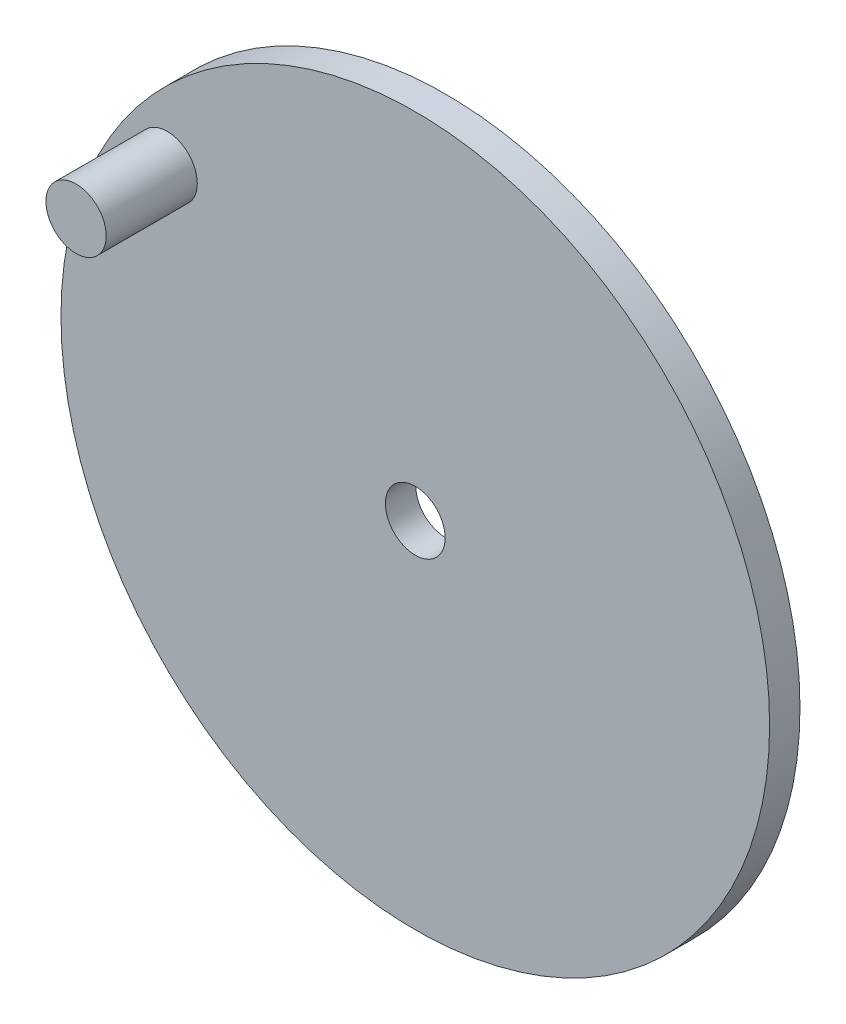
from build123d import *

# Parameters (mm, degrees)
SKETCH1_R           = 35
BOSS_EXTRUDE3_DEPTH = 3
SKETCH6_R           = 2.95
CUT_EXTRUDE2_DEPTH  = 3
BOSS_EXTRUDE4_START = 3
SKETCH9_R           = 2.975
BOSS_EXTRUDE4_DEPTH = 9


with BuildPart() as part:
    # Sketch1 → Boss-Extrude3 (new body)
    with BuildSketch(Plane.XY):
        Circle(SKETCH1_R)
    extrude(amount=BOSS_EXTRUDE3_DEPTH)

    # Sketch6 → Cut-Extrude2 (cut)
    with BuildSketch(Plane.XY.offset(3)):
        Circle(SKETCH6_R)
    extrude(amount=-CUT_EXTRUDE2_DEPTH, mode=Mode.SUBTRACT)


with BuildPart() as body_2:
    # Sketch9 → Boss-Extrude4 (new body)
    with BuildSketch(Plane.XY.offset(BOSS_EXTRUDE4_START)):
        with Locations((-24.507286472, 18.086377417)):
            Circle(SKETCH9_R)
    extrude(amount=BOSS_EXTRUDE4_DEPTH)


solid = Compound([part.part, body_2.part])
